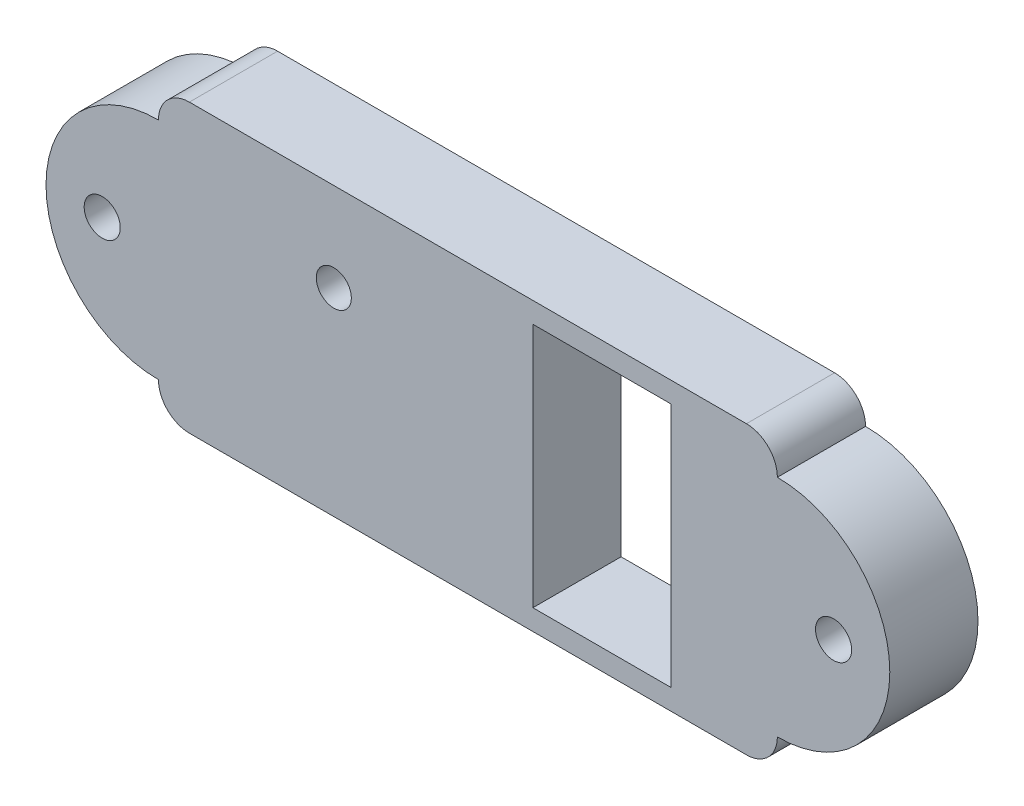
ISO-10303-21;
HEADER;
FILE_DESCRIPTION(('STEP AP214'),'2;1');
FILE_NAME('part.step','',(''),(''),'','','');
FILE_SCHEMA(('AUTOMOTIVE_DESIGN { 1 0 10303 214 1 1 1 1 }'));
ENDSEC;
DATA;
#1=APPLICATION_CONTEXT('core data for automotive mechanical design processes');
#2=APPLICATION_PROTOCOL_DEFINITION('international standard','automotive_design',2000,#1);
#3=PRODUCT_CONTEXT('',#1,'mechanical');
#4=PRODUCT('Part','Part','',(#3));
#5=PRODUCT_RELATED_PRODUCT_CATEGORY('part','',(#4));
#6=PRODUCT_DEFINITION_FORMATION('','',#4);
#7=PRODUCT_DEFINITION_CONTEXT('part definition',#1,'design');
#8=PRODUCT_DEFINITION('design','',#6,#7);
#9=PRODUCT_DEFINITION_SHAPE('','',#8);
#10=(LENGTH_UNIT() NAMED_UNIT(*) SI_UNIT(.MILLI.,.METRE.));
#11=(NAMED_UNIT(*) PLANE_ANGLE_UNIT() SI_UNIT($,.RADIAN.));
#12=(NAMED_UNIT(*) SI_UNIT($,.STERADIAN.) SOLID_ANGLE_UNIT());
#13=UNCERTAINTY_MEASURE_WITH_UNIT(LENGTH_MEASURE(1.E-05),#10,'distance_accuracy_value','');
#14=(GEOMETRIC_REPRESENTATION_CONTEXT(3) GLOBAL_UNCERTAINTY_ASSIGNED_CONTEXT((#13)) GLOBAL_UNIT_ASSIGNED_CONTEXT((#10,
#11,#12)) REPRESENTATION_CONTEXT('',''));
#15=CARTESIAN_POINT('',(0.,0.,0.));
#16=DIRECTION('',(0.,0.,1.));
#17=DIRECTION('',(1.,0.,0.));
#18=AXIS2_PLACEMENT_3D('',#15,#16,#17);
#19=CARTESIAN_POINT('',(0.,6.6,8.55));
#20=DIRECTION('',(0.,1.,0.));
#21=DIRECTION('',(0.,0.,1.));
#22=AXIS2_PLACEMENT_3D('',#19,#20,#21);
#23=PLANE('',#22);
#24=DIRECTION('',(1.,0.,0.));
#25=VECTOR('',#24,1.);
#26=CARTESIAN_POINT('',(0.,6.6,0.));
#27=LINE('',#26,#25);
#28=CARTESIAN_POINT('',(6.3,6.6,0.));
#29=VERTEX_POINT('',#28);
#30=CARTESIAN_POINT('',(19.7,6.6,0.));
#31=VERTEX_POINT('',#30);
#32=EDGE_CURVE('E176',#29,#31,#27,.T.);
#33=ORIENTED_EDGE('',*,*,#32,.T.);
#34=DIRECTION('',(0.,0.,-1.));
#35=VECTOR('',#34,1.);
#36=CARTESIAN_POINT('',(19.7,6.6,8.55));
#37=LINE('',#36,#35);
#38=CARTESIAN_POINT('',(19.7,6.6,8.55));
#39=VERTEX_POINT('',#38);
#40=EDGE_CURVE('E11',#39,#31,#37,.T.);
#41=ORIENTED_EDGE('',*,*,#40,.F.);
#42=DIRECTION('',(1.,0.,0.));
#43=VECTOR('',#42,1.);
#44=CARTESIAN_POINT('',(0.,6.6,8.55));
#45=LINE('',#44,#43);
#46=CARTESIAN_POINT('',(6.3,6.6,8.55));
#47=VERTEX_POINT('',#46);
#48=EDGE_CURVE('E141',#47,#39,#45,.T.);
#49=ORIENTED_EDGE('',*,*,#48,.F.);
#50=DIRECTION('',(0.,0.,-1.));
#51=VECTOR('',#50,1.);
#52=CARTESIAN_POINT('',(6.3,6.6,8.55));
#53=LINE('',#52,#51);
#54=EDGE_CURVE('E60',#47,#29,#53,.T.);
#55=ORIENTED_EDGE('',*,*,#54,.T.);
#56=EDGE_LOOP('',(#33,#41,#49,#55));
#57=FACE_BOUND('',#56,.T.);
#58=ADVANCED_FACE('F41',(#57),#23,.F.);
#59=CARTESIAN_POINT('',(19.7,0.,8.55));
#60=DIRECTION('',(1.,0.,0.));
#61=DIRECTION('',(0.,0.,-1.));
#62=AXIS2_PLACEMENT_3D('',#59,#60,#61);
#63=PLANE('',#62);
#64=DIRECTION('',(0.,-1.,0.));
#65=VECTOR('',#64,1.);
#66=CARTESIAN_POINT('',(19.7,0.,0.));
#67=LINE('',#66,#65);
#68=CARTESIAN_POINT('',(19.7,-17.2,0.));
#69=VERTEX_POINT('',#68);
#70=EDGE_CURVE('E147',#31,#69,#67,.T.);
#71=ORIENTED_EDGE('',*,*,#70,.T.);
#72=DIRECTION('',(0.,0.,-1.));
#73=VECTOR('',#72,1.);
#74=CARTESIAN_POINT('',(19.7,-17.2,8.55));
#75=LINE('',#74,#73);
#76=CARTESIAN_POINT('',(19.7,-17.2,8.55));
#77=VERTEX_POINT('',#76);
#78=EDGE_CURVE('E51',#77,#69,#75,.T.);
#79=ORIENTED_EDGE('',*,*,#78,.F.);
#80=DIRECTION('',(0.,-1.,0.));
#81=VECTOR('',#80,1.);
#82=CARTESIAN_POINT('',(19.7,0.,8.55));
#83=LINE('',#82,#81);
#84=EDGE_CURVE('E134',#39,#77,#83,.T.);
#85=ORIENTED_EDGE('',*,*,#84,.F.);
#86=ORIENTED_EDGE('',*,*,#40,.T.);
#87=EDGE_LOOP('',(#71,#79,#85,#86));
#88=FACE_BOUND('',#87,.T.);
#89=ADVANCED_FACE('F146',(#88),#63,.F.);
#90=CARTESIAN_POINT('',(0.,-17.2,8.55));
#91=DIRECTION('',(0.,1.,0.));
#92=DIRECTION('',(0.,0.,1.));
#93=AXIS2_PLACEMENT_3D('',#90,#91,#92);
#94=PLANE('',#93);
#95=DIRECTION('',(1.,0.,0.));
#96=VECTOR('',#95,1.);
#97=CARTESIAN_POINT('',(0.,-17.2,0.));
#98=LINE('',#97,#96);
#99=CARTESIAN_POINT('',(6.3,-17.2,0.));
#100=VERTEX_POINT('',#99);
#101=EDGE_CURVE('E179',#100,#69,#98,.T.);
#102=ORIENTED_EDGE('',*,*,#101,.F.);
#103=DIRECTION('',(0.,0.,-1.));
#104=VECTOR('',#103,1.);
#105=CARTESIAN_POINT('',(6.3,-17.2,8.55));
#106=LINE('',#105,#104);
#107=CARTESIAN_POINT('',(6.3,-17.2,8.55));
#108=VERTEX_POINT('',#107);
#109=EDGE_CURVE('E93',#108,#100,#106,.T.);
#110=ORIENTED_EDGE('',*,*,#109,.F.);
#111=DIRECTION('',(1.,0.,0.));
#112=VECTOR('',#111,1.);
#113=CARTESIAN_POINT('',(0.,-17.2,8.55));
#114=LINE('',#113,#112);
#115=EDGE_CURVE('E140',#108,#77,#114,.T.);
#116=ORIENTED_EDGE('',*,*,#115,.T.);
#117=ORIENTED_EDGE('',*,*,#78,.T.);
#118=EDGE_LOOP('',(#102,#110,#116,#117));
#119=FACE_BOUND('',#118,.T.);
#120=ADVANCED_FACE('F151',(#119),#94,.T.);
#121=CARTESIAN_POINT('',(-27.,-16.2,8.55));
#122=DIRECTION('',(0.,0.,-1.));
#123=DIRECTION('',(-1.,0.,0.));
#124=AXIS2_PLACEMENT_3D('',#121,#122,#123);
#125=CYLINDRICAL_SURFACE('',#124,3.);
#126=CARTESIAN_POINT('',(-27.,-16.2,0.));
#127=DIRECTION('',(0.,0.,1.));
#128=DIRECTION('',(1.,0.,0.));
#129=AXIS2_PLACEMENT_3D('',#126,#127,#128);
#130=CIRCLE('',#129,3.);
#131=CARTESIAN_POINT('',(-27.,-19.2,0.));
#132=VERTEX_POINT('',#131);
#133=CARTESIAN_POINT('',(-30.,-16.2,0.));
#134=VERTEX_POINT('',#133);
#135=EDGE_CURVE('E158',#132,#134,#130,.F.);
#136=ORIENTED_EDGE('',*,*,#135,.F.);
#137=DIRECTION('',(0.,0.,-1.));
#138=VECTOR('',#137,1.);
#139=CARTESIAN_POINT('',(-27.,-19.2,8.55));
#140=LINE('',#139,#138);
#141=CARTESIAN_POINT('',(-27.,-19.2,8.55));
#142=VERTEX_POINT('',#141);
#143=EDGE_CURVE('E45',#142,#132,#140,.T.);
#144=ORIENTED_EDGE('',*,*,#143,.F.);
#145=CARTESIAN_POINT('',(-27.,-16.2,8.55));
#146=DIRECTION('',(0.,0.,1.));
#147=DIRECTION('',(1.,0.,0.));
#148=AXIS2_PLACEMENT_3D('',#145,#146,#147);
#149=CIRCLE('',#148,3.);
#150=CARTESIAN_POINT('',(-30.,-16.2,8.55));
#151=VERTEX_POINT('',#150);
#152=EDGE_CURVE('E184',#142,#151,#149,.F.);
#153=ORIENTED_EDGE('',*,*,#152,.T.);
#154=DIRECTION('',(0.,0.,-1.));
#155=VECTOR('',#154,1.);
#156=CARTESIAN_POINT('',(-30.,-16.2,8.55));
#157=LINE('',#156,#155);
#158=EDGE_CURVE('E154',#151,#134,#157,.T.);
#159=ORIENTED_EDGE('',*,*,#158,.T.);
#160=EDGE_LOOP('',(#136,#144,#153,#159));
#161=FACE_BOUND('',#160,.T.);
#162=ADVANCED_FACE('F43',(#161),#125,.T.);
#163=CARTESIAN_POINT('',(0.,-19.2,8.55));
#164=DIRECTION('',(0.,1.,0.));
#165=DIRECTION('',(-1.,0.,0.));
#166=AXIS2_PLACEMENT_3D('',#163,#164,#165);
#167=PLANE('',#166);
#168=DIRECTION('',(1.,0.,0.));
#169=VECTOR('',#168,1.);
#170=CARTESIAN_POINT('',(0.,-19.2,0.));
#171=LINE('',#170,#169);
#172=CARTESIAN_POINT('',(27.,-19.2,0.));
#173=VERTEX_POINT('',#172);
#174=EDGE_CURVE('E161',#132,#173,#171,.T.);
#175=ORIENTED_EDGE('',*,*,#174,.T.);
#176=DIRECTION('',(0.,0.,-1.));
#177=VECTOR('',#176,1.);
#178=CARTESIAN_POINT('',(27.,-19.2,8.55));
#179=LINE('',#178,#177);
#180=CARTESIAN_POINT('',(27.,-19.2,8.55));
#181=VERTEX_POINT('',#180);
#182=EDGE_CURVE('E202',#181,#173,#179,.T.);
#183=ORIENTED_EDGE('',*,*,#182,.F.);
#184=DIRECTION('',(1.,0.,0.));
#185=VECTOR('',#184,1.);
#186=CARTESIAN_POINT('',(0.,-19.2,8.55));
#187=LINE('',#186,#185);
#188=EDGE_CURVE('E211',#142,#181,#187,.T.);
#189=ORIENTED_EDGE('',*,*,#188,.F.);
#190=ORIENTED_EDGE('',*,*,#143,.T.);
#191=EDGE_LOOP('',(#175,#183,#189,#190));
#192=FACE_BOUND('',#191,.T.);
#193=ADVANCED_FACE('F210',(#192),#167,.F.);
#194=CARTESIAN_POINT('',(27.,-16.2,8.55));
#195=DIRECTION('',(0.,0.,-1.));
#196=DIRECTION('',(-1.,0.,0.));
#197=AXIS2_PLACEMENT_3D('',#194,#195,#196);
#198=CYLINDRICAL_SURFACE('',#197,2.99999999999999);
#199=CARTESIAN_POINT('',(27.,-16.2,0.));
#200=DIRECTION('',(0.,0.,1.));
#201=DIRECTION('',(1.,0.,0.));
#202=AXIS2_PLACEMENT_3D('',#199,#200,#201);
#203=CIRCLE('',#202,2.99999999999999);
#204=CARTESIAN_POINT('',(30.,-16.2,0.));
#205=VERTEX_POINT('',#204);
#206=EDGE_CURVE('E164',#173,#205,#203,.T.);
#207=ORIENTED_EDGE('',*,*,#206,.T.);
#208=DIRECTION('',(0.,0.,-1.));
#209=VECTOR('',#208,1.);
#210=CARTESIAN_POINT('',(30.,-16.2,8.55));
#211=LINE('',#210,#209);
#212=CARTESIAN_POINT('',(30.,-16.2,8.55));
#213=VERTEX_POINT('',#212);
#214=EDGE_CURVE('E200',#213,#205,#211,.T.);
#215=ORIENTED_EDGE('',*,*,#214,.F.);
#216=CARTESIAN_POINT('',(27.,-16.2,8.55));
#217=DIRECTION('',(0.,0.,1.));
#218=DIRECTION('',(1.,0.,0.));
#219=AXIS2_PLACEMENT_3D('',#216,#217,#218);
#220=CIRCLE('',#219,2.99999999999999);
#221=EDGE_CURVE('E250',#181,#213,#220,.T.);
#222=ORIENTED_EDGE('',*,*,#221,.F.);
#223=ORIENTED_EDGE('',*,*,#182,.T.);
#224=EDGE_LOOP('',(#207,#215,#222,#223));
#225=FACE_BOUND('',#224,.T.);
#226=ADVANCED_FACE('F298',(#225),#198,.T.);
#227=CARTESIAN_POINT('',(27.,5.60000000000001,8.55));
#228=DIRECTION('',(0.,0.,-1.));
#229=DIRECTION('',(-1.,0.,0.));
#230=AXIS2_PLACEMENT_3D('',#227,#228,#229);
#231=CYLINDRICAL_SURFACE('',#230,2.99999999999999);
#232=CARTESIAN_POINT('',(27.,5.60000000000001,0.));
#233=DIRECTION('',(0.,0.,1.));
#234=DIRECTION('',(1.,0.,0.));
#235=AXIS2_PLACEMENT_3D('',#232,#233,#234);
#236=CIRCLE('',#235,2.99999999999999);
#237=CARTESIAN_POINT('',(27.,8.6,0.));
#238=VERTEX_POINT('',#237);
#239=CARTESIAN_POINT('',(30.,5.60000000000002,0.));
#240=VERTEX_POINT('',#239);
#241=EDGE_CURVE('E166',#238,#240,#236,.F.);
#242=ORIENTED_EDGE('',*,*,#241,.F.);
#243=DIRECTION('',(0.,0.,-1.));
#244=VECTOR('',#243,1.);
#245=CARTESIAN_POINT('',(27.,8.6,8.55));
#246=LINE('',#245,#244);
#247=CARTESIAN_POINT('',(27.,8.6,8.55));
#248=VERTEX_POINT('',#247);
#249=EDGE_CURVE('E195',#248,#238,#246,.T.);
#250=ORIENTED_EDGE('',*,*,#249,.F.);
#251=CARTESIAN_POINT('',(27.,5.60000000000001,8.55));
#252=DIRECTION('',(0.,0.,1.));
#253=DIRECTION('',(1.,0.,0.));
#254=AXIS2_PLACEMENT_3D('',#251,#252,#253);
#255=CIRCLE('',#254,2.99999999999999);
#256=CARTESIAN_POINT('',(30.,5.60000000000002,8.55));
#257=VERTEX_POINT('',#256);
#258=EDGE_CURVE('E252',#248,#257,#255,.F.);
#259=ORIENTED_EDGE('',*,*,#258,.T.);
#260=DIRECTION('',(0.,0.,-1.));
#261=VECTOR('',#260,1.);
#262=CARTESIAN_POINT('',(30.,5.60000000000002,8.55));
#263=LINE('',#262,#261);
#264=EDGE_CURVE('E197',#257,#240,#263,.T.);
#265=ORIENTED_EDGE('',*,*,#264,.T.);
#266=EDGE_LOOP('',(#242,#250,#259,#265));
#267=FACE_BOUND('',#266,.T.);
#268=ADVANCED_FACE('F294',(#267),#231,.T.);
#269=CARTESIAN_POINT('',(0.,8.6,8.55));
#270=DIRECTION('',(0.,-1.,0.));
#271=DIRECTION('',(1.,0.,0.));
#272=AXIS2_PLACEMENT_3D('',#269,#270,#271);
#273=PLANE('',#272);
#274=DIRECTION('',(-1.,0.,0.));
#275=VECTOR('',#274,1.);
#276=CARTESIAN_POINT('',(0.,8.6,0.));
#277=LINE('',#276,#275);
#278=CARTESIAN_POINT('',(-27.,8.59999999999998,0.));
#279=VERTEX_POINT('',#278);
#280=EDGE_CURVE('E169',#238,#279,#277,.T.);
#281=ORIENTED_EDGE('',*,*,#280,.T.);
#282=DIRECTION('',(0.,0.,-1.));
#283=VECTOR('',#282,1.);
#284=CARTESIAN_POINT('',(-27.,8.59999999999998,8.55));
#285=LINE('',#284,#283);
#286=CARTESIAN_POINT('',(-27.,8.59999999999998,8.55));
#287=VERTEX_POINT('',#286);
#288=EDGE_CURVE('E192',#287,#279,#285,.T.);
#289=ORIENTED_EDGE('',*,*,#288,.F.);
#290=DIRECTION('',(-1.,0.,0.));
#291=VECTOR('',#290,1.);
#292=CARTESIAN_POINT('',(0.,8.6,8.55));
#293=LINE('',#292,#291);
#294=EDGE_CURVE('E254',#248,#287,#293,.T.);
#295=ORIENTED_EDGE('',*,*,#294,.F.);
#296=ORIENTED_EDGE('',*,*,#249,.T.);
#297=EDGE_LOOP('',(#281,#289,#295,#296));
#298=FACE_BOUND('',#297,.T.);
#299=ADVANCED_FACE('F290',(#298),#273,.F.);
#300=CARTESIAN_POINT('',(-27.,5.6,8.55));
#301=DIRECTION('',(0.,0.,-1.));
#302=DIRECTION('',(-1.,0.,0.));
#303=AXIS2_PLACEMENT_3D('',#300,#301,#302);
#304=CYLINDRICAL_SURFACE('',#303,2.99999999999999);
#305=CARTESIAN_POINT('',(-27.,5.6,0.));
#306=DIRECTION('',(0.,0.,1.));
#307=DIRECTION('',(1.,0.,0.));
#308=AXIS2_PLACEMENT_3D('',#305,#306,#307);
#309=CIRCLE('',#308,2.99999999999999);
#310=CARTESIAN_POINT('',(-30.,5.6,0.));
#311=VERTEX_POINT('',#310);
#312=EDGE_CURVE('E171',#279,#311,#309,.T.);
#313=ORIENTED_EDGE('',*,*,#312,.T.);
#314=DIRECTION('',(0.,0.,-1.));
#315=VECTOR('',#314,1.);
#316=CARTESIAN_POINT('',(-30.,5.6,8.55));
#317=LINE('',#316,#315);
#318=CARTESIAN_POINT('',(-30.,5.6,8.55));
#319=VERTEX_POINT('',#318);
#320=EDGE_CURVE('E189',#319,#311,#317,.T.);
#321=ORIENTED_EDGE('',*,*,#320,.F.);
#322=CARTESIAN_POINT('',(-27.,5.6,8.55));
#323=DIRECTION('',(0.,0.,1.));
#324=DIRECTION('',(1.,0.,0.));
#325=AXIS2_PLACEMENT_3D('',#322,#323,#324);
#326=CIRCLE('',#325,2.99999999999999);
#327=EDGE_CURVE('E256',#287,#319,#326,.T.);
#328=ORIENTED_EDGE('',*,*,#327,.F.);
#329=ORIENTED_EDGE('',*,*,#288,.T.);
#330=EDGE_LOOP('',(#313,#321,#328,#329));
#331=FACE_BOUND('',#330,.T.);
#332=ADVANCED_FACE('F288',(#331),#304,.T.);
#333=CARTESIAN_POINT('',(-13.,0.,8.55));
#334=DIRECTION('',(0.,0.,-1.));
#335=DIRECTION('',(-1.,0.,0.));
#336=AXIS2_PLACEMENT_3D('',#333,#334,#335);
#337=CYLINDRICAL_SURFACE('',#336,1.7);
#338=CARTESIAN_POINT('',(-13.,0.,8.55));
#339=DIRECTION('',(0.,0.,1.));
#340=DIRECTION('',(1.,0.,0.));
#341=AXIS2_PLACEMENT_3D('',#338,#339,#340);
#342=CIRCLE('',#341,1.7);
#343=CARTESIAN_POINT('',(-11.3,0.,8.55));
#344=VERTEX_POINT('',#343);
#345=EDGE_CURVE('E258',#344,#344,#342,.T.);
#346=ORIENTED_EDGE('',*,*,#345,.T.);
#347=EDGE_LOOP('',(#346));
#348=FACE_BOUND('',#347,.T.);
#349=CARTESIAN_POINT('',(-13.,0.,0.));
#350=DIRECTION('',(0.,0.,1.));
#351=DIRECTION('',(1.,0.,0.));
#352=AXIS2_PLACEMENT_3D('',#349,#350,#351);
#353=CIRCLE('',#352,1.7);
#354=CARTESIAN_POINT('',(-11.3,0.,0.));
#355=VERTEX_POINT('',#354);
#356=EDGE_CURVE('E173',#355,#355,#353,.T.);
#357=ORIENTED_EDGE('',*,*,#356,.F.);
#358=EDGE_LOOP('',(#357));
#359=FACE_BOUND('',#358,.T.);
#360=ADVANCED_FACE('F262',(#348,#359),#337,.F.);
#361=CARTESIAN_POINT('',(6.3,0.,8.55));
#362=DIRECTION('',(1.,0.,0.));
#363=DIRECTION('',(0.,0.,-1.));
#364=AXIS2_PLACEMENT_3D('',#361,#362,#363);
#365=PLANE('',#364);
#366=DIRECTION('',(0.,-1.,0.));
#367=VECTOR('',#366,1.);
#368=CARTESIAN_POINT('',(6.3,0.,0.));
#369=LINE('',#368,#367);
#370=EDGE_CURVE('E181',#29,#100,#369,.T.);
#371=ORIENTED_EDGE('',*,*,#370,.F.);
#372=ORIENTED_EDGE('',*,*,#54,.F.);
#373=DIRECTION('',(0.,-1.,0.));
#374=VECTOR('',#373,1.);
#375=CARTESIAN_POINT('',(6.3,0.,8.55));
#376=LINE('',#375,#374);
#377=EDGE_CURVE('E152',#47,#108,#376,.T.);
#378=ORIENTED_EDGE('',*,*,#377,.T.);
#379=ORIENTED_EDGE('',*,*,#109,.T.);
#380=EDGE_LOOP('',(#371,#372,#378,#379));
#381=FACE_BOUND('',#380,.T.);
#382=ADVANCED_FACE('F266',(#381),#365,.T.);
#383=CARTESIAN_POINT('',(0.,0.,8.55));
#384=DIRECTION('',(0.,0.,1.));
#385=DIRECTION('',(1.,0.,0.));
#386=AXIS2_PLACEMENT_3D('',#383,#384,#385);
#387=PLANE('',#386);
#388=ORIENTED_EDGE('',*,*,#152,.F.);
#389=ORIENTED_EDGE('',*,*,#188,.T.);
#390=ORIENTED_EDGE('',*,*,#221,.T.);
#391=CARTESIAN_POINT('',(30.,-5.3,8.55));
#392=DIRECTION('',(0.,0.,-1.));
#393=DIRECTION('',(-1.,0.,0.));
#394=AXIS2_PLACEMENT_3D('',#391,#392,#393);
#395=CIRCLE('',#394,10.9);
#396=EDGE_CURVE('E162',#257,#213,#395,.T.);
#397=ORIENTED_EDGE('',*,*,#396,.F.);
#398=ORIENTED_EDGE('',*,*,#258,.F.);
#399=ORIENTED_EDGE('',*,*,#294,.T.);
#400=ORIENTED_EDGE('',*,*,#327,.T.);
#401=CARTESIAN_POINT('',(-30.,-5.3,8.55));
#402=DIRECTION('',(0.,0.,-1.));
#403=DIRECTION('',(-1.,0.,0.));
#404=AXIS2_PLACEMENT_3D('',#401,#402,#403);
#405=CIRCLE('',#404,10.9);
#406=EDGE_CURVE('E229',#151,#319,#405,.T.);
#407=ORIENTED_EDGE('',*,*,#406,.F.);
#408=EDGE_LOOP('',(#388,#389,#390,#397,#398,#399,#400,#407));
#409=FACE_BOUND('',#408,.T.);
#410=ORIENTED_EDGE('',*,*,#345,.F.);
#411=EDGE_LOOP('',(#410));
#412=FACE_BOUND('',#411,.T.);
#413=ORIENTED_EDGE('',*,*,#48,.T.);
#414=ORIENTED_EDGE('',*,*,#84,.T.);
#415=ORIENTED_EDGE('',*,*,#115,.F.);
#416=ORIENTED_EDGE('',*,*,#377,.F.);
#417=EDGE_LOOP('',(#413,#414,#415,#416));
#418=FACE_BOUND('',#417,.T.);
#419=CARTESIAN_POINT('',(35.45,-5.3,8.55));
#420=DIRECTION('',(0.,0.,-1.));
#421=DIRECTION('',(-1.,0.,0.));
#422=AXIS2_PLACEMENT_3D('',#419,#420,#421);
#423=CIRCLE('',#422,1.75);
#424=CARTESIAN_POINT('',(33.7,-5.3,8.55));
#425=VERTEX_POINT('',#424);
#426=EDGE_CURVE('E239',#425,#425,#423,.T.);
#427=ORIENTED_EDGE('',*,*,#426,.T.);
#428=EDGE_LOOP('',(#427));
#429=FACE_BOUND('',#428,.T.);
#430=CARTESIAN_POINT('',(-35.45,-5.3,8.55));
#431=DIRECTION('',(0.,0.,-1.));
#432=DIRECTION('',(-1.,0.,0.));
#433=AXIS2_PLACEMENT_3D('',#430,#431,#432);
#434=CIRCLE('',#433,1.75);
#435=CARTESIAN_POINT('',(-37.2,-5.3,8.55));
#436=VERTEX_POINT('',#435);
#437=EDGE_CURVE('E228',#436,#436,#434,.T.);
#438=ORIENTED_EDGE('',*,*,#437,.T.);
#439=EDGE_LOOP('',(#438));
#440=FACE_BOUND('',#439,.T.);
#441=ADVANCED_FACE('F136',(#409,#412,#418,#429,#440),#387,.T.);
#442=CARTESIAN_POINT('',(0.,0.,0.));
#443=DIRECTION('',(0.,0.,1.));
#444=DIRECTION('',(1.,0.,0.));
#445=AXIS2_PLACEMENT_3D('',#442,#443,#444);
#446=PLANE('',#445);
#447=ORIENTED_EDGE('',*,*,#135,.T.);
#448=CARTESIAN_POINT('',(-30.,-5.3,0.));
#449=DIRECTION('',(0.,0.,-1.));
#450=DIRECTION('',(-1.,0.,0.));
#451=AXIS2_PLACEMENT_3D('',#448,#449,#450);
#452=CIRCLE('',#451,10.9);
#453=EDGE_CURVE('E224',#134,#311,#452,.T.);
#454=ORIENTED_EDGE('',*,*,#453,.T.);
#455=ORIENTED_EDGE('',*,*,#312,.F.);
#456=ORIENTED_EDGE('',*,*,#280,.F.);
#457=ORIENTED_EDGE('',*,*,#241,.T.);
#458=CARTESIAN_POINT('',(30.,-5.3,0.));
#459=DIRECTION('',(0.,0.,-1.));
#460=DIRECTION('',(-1.,0.,0.));
#461=AXIS2_PLACEMENT_3D('',#458,#459,#460);
#462=CIRCLE('',#461,10.9);
#463=EDGE_CURVE('E242',#240,#205,#462,.T.);
#464=ORIENTED_EDGE('',*,*,#463,.T.);
#465=ORIENTED_EDGE('',*,*,#206,.F.);
#466=ORIENTED_EDGE('',*,*,#174,.F.);
#467=EDGE_LOOP('',(#447,#454,#455,#456,#457,#464,#465,#466));
#468=FACE_BOUND('',#467,.T.);
#469=ORIENTED_EDGE('',*,*,#356,.T.);
#470=EDGE_LOOP('',(#469));
#471=FACE_BOUND('',#470,.T.);
#472=ORIENTED_EDGE('',*,*,#32,.F.);
#473=ORIENTED_EDGE('',*,*,#370,.T.);
#474=ORIENTED_EDGE('',*,*,#101,.T.);
#475=ORIENTED_EDGE('',*,*,#70,.F.);
#476=EDGE_LOOP('',(#472,#473,#474,#475));
#477=FACE_BOUND('',#476,.T.);
#478=CARTESIAN_POINT('',(35.45,-5.3,0.));
#479=DIRECTION('',(0.,0.,-1.));
#480=DIRECTION('',(-1.,0.,0.));
#481=AXIS2_PLACEMENT_3D('',#478,#479,#480);
#482=CIRCLE('',#481,1.75);
#483=CARTESIAN_POINT('',(33.7,-5.3,0.));
#484=VERTEX_POINT('',#483);
#485=EDGE_CURVE('E237',#484,#484,#482,.T.);
#486=ORIENTED_EDGE('',*,*,#485,.F.);
#487=EDGE_LOOP('',(#486));
#488=FACE_BOUND('',#487,.T.);
#489=CARTESIAN_POINT('',(-35.45,-5.3,0.));
#490=DIRECTION('',(0.,0.,-1.));
#491=DIRECTION('',(-1.,0.,0.));
#492=AXIS2_PLACEMENT_3D('',#489,#490,#491);
#493=CIRCLE('',#492,1.75);
#494=CARTESIAN_POINT('',(-37.2,-5.3,0.));
#495=VERTEX_POINT('',#494);
#496=EDGE_CURVE('E232',#495,#495,#493,.T.);
#497=ORIENTED_EDGE('',*,*,#496,.F.);
#498=EDGE_LOOP('',(#497));
#499=FACE_BOUND('',#498,.T.);
#500=ADVANCED_FACE('F214',(#468,#471,#477,#488,#499),#446,.F.);
#501=CARTESIAN_POINT('',(30.,-5.3,8.55));
#502=DIRECTION('',(0.,0.,-1.));
#503=DIRECTION('',(-1.,0.,0.));
#504=AXIS2_PLACEMENT_3D('',#501,#502,#503);
#505=CYLINDRICAL_SURFACE('',#504,10.9);
#506=ORIENTED_EDGE('',*,*,#463,.F.);
#507=ORIENTED_EDGE('',*,*,#264,.F.);
#508=ORIENTED_EDGE('',*,*,#396,.T.);
#509=ORIENTED_EDGE('',*,*,#214,.T.);
#510=EDGE_LOOP('',(#506,#507,#508,#509));
#511=FACE_BOUND('',#510,.T.);
#512=ADVANCED_FACE('F273',(#511),#505,.T.);
#513=CARTESIAN_POINT('',(35.45,-5.3,8.55));
#514=DIRECTION('',(0.,0.,-1.));
#515=DIRECTION('',(-1.,0.,0.));
#516=AXIS2_PLACEMENT_3D('',#513,#514,#515);
#517=CYLINDRICAL_SURFACE('',#516,1.75);
#518=ORIENTED_EDGE('',*,*,#426,.F.);
#519=EDGE_LOOP('',(#518));
#520=FACE_BOUND('',#519,.T.);
#521=ORIENTED_EDGE('',*,*,#485,.T.);
#522=EDGE_LOOP('',(#521));
#523=FACE_BOUND('',#522,.T.);
#524=ADVANCED_FACE('F380',(#520,#523),#517,.F.);
#525=CARTESIAN_POINT('',(-30.,-5.3,8.55));
#526=DIRECTION('',(0.,0.,-1.));
#527=DIRECTION('',(-1.,0.,0.));
#528=AXIS2_PLACEMENT_3D('',#525,#526,#527);
#529=CYLINDRICAL_SURFACE('',#528,10.9);
#530=ORIENTED_EDGE('',*,*,#453,.F.);
#531=ORIENTED_EDGE('',*,*,#158,.F.);
#532=ORIENTED_EDGE('',*,*,#406,.T.);
#533=ORIENTED_EDGE('',*,*,#320,.T.);
#534=EDGE_LOOP('',(#530,#531,#532,#533));
#535=FACE_BOUND('',#534,.T.);
#536=ADVANCED_FACE('F225',(#535),#529,.T.);
#537=CARTESIAN_POINT('',(-35.45,-5.3,8.55));
#538=DIRECTION('',(0.,0.,-1.));
#539=DIRECTION('',(-1.,0.,0.));
#540=AXIS2_PLACEMENT_3D('',#537,#538,#539);
#541=CYLINDRICAL_SURFACE('',#540,1.75);
#542=ORIENTED_EDGE('',*,*,#437,.F.);
#543=EDGE_LOOP('',(#542));
#544=FACE_BOUND('',#543,.T.);
#545=ORIENTED_EDGE('',*,*,#496,.T.);
#546=EDGE_LOOP('',(#545));
#547=FACE_BOUND('',#546,.T.);
#548=ADVANCED_FACE('F397',(#544,#547),#541,.F.);
#549=CLOSED_SHELL('',(#58,#89,#120,#162,#193,#226,#268,#299,#332,#360,#382,#441,#500,#512,#524,
#536,#548));
#550=MANIFOLD_SOLID_BREP('B2',#549);
#551=ADVANCED_BREP_SHAPE_REPRESENTATION('',(#18,#550),#14);
#552=SHAPE_DEFINITION_REPRESENTATION(#9,#551);
ENDSEC;
END-ISO-10303-21;
